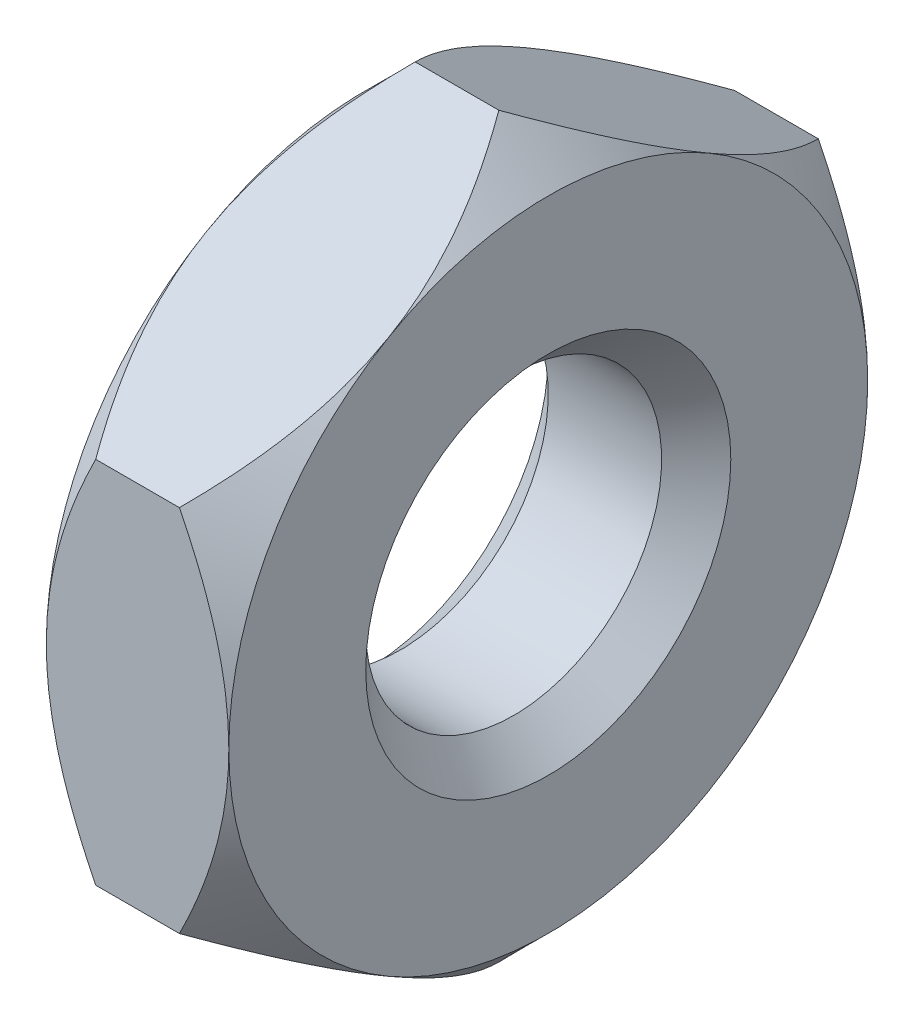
ISO-10303-21;
HEADER;
FILE_DESCRIPTION(('STEP AP214'),'2;1');
FILE_NAME('part.step','',(''),(''),'','','');
FILE_SCHEMA(('AUTOMOTIVE_DESIGN { 1 0 10303 214 1 1 1 1 }'));
ENDSEC;
DATA;
#1=APPLICATION_CONTEXT('core data for automotive mechanical design processes');
#2=APPLICATION_PROTOCOL_DEFINITION('international standard','automotive_design',2000,#1);
#3=PRODUCT_CONTEXT('',#1,'mechanical');
#4=PRODUCT('Part','Part','',(#3));
#5=PRODUCT_RELATED_PRODUCT_CATEGORY('part','',(#4));
#6=PRODUCT_DEFINITION_FORMATION('','',#4);
#7=PRODUCT_DEFINITION_CONTEXT('part definition',#1,'design');
#8=PRODUCT_DEFINITION('design','',#6,#7);
#9=PRODUCT_DEFINITION_SHAPE('','',#8);
#10=(LENGTH_UNIT() NAMED_UNIT(*) SI_UNIT(.MILLI.,.METRE.));
#11=(NAMED_UNIT(*) PLANE_ANGLE_UNIT() SI_UNIT($,.RADIAN.));
#12=(NAMED_UNIT(*) SI_UNIT($,.STERADIAN.) SOLID_ANGLE_UNIT());
#13=UNCERTAINTY_MEASURE_WITH_UNIT(LENGTH_MEASURE(1.E-05),#10,'distance_accuracy_value','');
#14=(GEOMETRIC_REPRESENTATION_CONTEXT(3) GLOBAL_UNCERTAINTY_ASSIGNED_CONTEXT((#13)) GLOBAL_UNIT_ASSIGNED_CONTEXT((#10,
#11,#12)) REPRESENTATION_CONTEXT('',''));
#15=CARTESIAN_POINT('',(0.,0.,0.));
#16=DIRECTION('',(0.,0.,1.));
#17=DIRECTION('',(1.,0.,0.));
#18=AXIS2_PLACEMENT_3D('',#15,#16,#17);
#19=CARTESIAN_POINT('',(0.7,0.,0.));
#20=DIRECTION('',(1.,0.,0.));
#21=DIRECTION('',(0.,0.,-1.));
#22=AXIS2_PLACEMENT_3D('',#19,#20,#21);
#23=CONICAL_SURFACE('',#22,4.2,0.785398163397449);
#24=CARTESIAN_POINT('',(0.541567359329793,-2.02061047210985,-3.5002));
#25=CARTESIAN_POINT('',(0.472167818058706,-2.09007076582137,-3.37989124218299));
#26=CARTESIAN_POINT('',(0.406844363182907,-2.16069251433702,-3.25757078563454));
#27=CARTESIAN_POINT('',(0.28723893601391,-2.30469791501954,-3.00814611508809));
#28=CARTESIAN_POINT('',(0.233023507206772,-2.37809526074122,-2.88101818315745));
#29=CARTESIAN_POINT('',(0.140151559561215,-2.52609746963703,-2.62467083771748));
#30=CARTESIAN_POINT('',(0.1012616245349,-2.60066464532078,-2.49551670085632));
#31=CARTESIAN_POINT('',(0.0413437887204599,-2.75144053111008,-2.23436520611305));
#32=CARTESIAN_POINT('',(0.0202711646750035,-2.82764463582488,-2.10237582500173));
#33=CARTESIAN_POINT('',(0.00125799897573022,-2.9589800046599,-1.87489629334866));
#34=CARTESIAN_POINT('',(-0.00155641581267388,-3.01394167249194,-1.77969989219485));
#35=CARTESIAN_POINT('',(0.00318657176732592,-3.1237756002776,-1.58946194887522));
#36=CARTESIAN_POINT('',(0.0107476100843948,-3.17864782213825,-1.49442047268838));
#37=CARTESIAN_POINT('',(0.0358097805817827,-3.28787240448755,-1.30523794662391));
#38=CARTESIAN_POINT('',(0.0533220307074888,-3.34222411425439,-1.21109802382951));
#39=CARTESIAN_POINT('',(0.0973307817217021,-3.4499940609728,-1.02443500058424));
#40=CARTESIAN_POINT('',(0.123826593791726,-3.50341236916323,-0.931911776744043));
#41=CARTESIAN_POINT('',(0.178339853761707,-3.59824414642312,-0.767658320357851));
#42=CARTESIAN_POINT('',(0.204924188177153,-3.63986754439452,-0.695564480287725));
#43=CARTESIAN_POINT('',(0.262377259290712,-3.72236709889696,-0.552671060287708));
#44=CARTESIAN_POINT('',(0.293246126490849,-3.76324323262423,-0.481871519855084));
#45=CARTESIAN_POINT('',(0.358576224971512,-3.84411947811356,-0.341789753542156));
#46=CARTESIAN_POINT('',(0.393026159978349,-3.88412189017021,-0.272503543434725));
#47=CARTESIAN_POINT('',(0.465065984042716,-3.96338588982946,-0.135214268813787));
#48=CARTESIAN_POINT('',(0.502653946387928,-4.00264791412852,-0.0672104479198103));
#49=CARTESIAN_POINT('',(0.541567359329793,-4.04156735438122,0.000199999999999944));
#50=B_SPLINE_CURVE_WITH_KNOTS('',3,(#24,#25,#26,#27,#28,#29,#30,#31,#32,#33,#34,#35,#36,#37,#38,
#39,#40,#41,#42,#43,#44,#45,#46,#47,#48,#49),.UNSPECIFIED.,.F.,.F.,(4,2,2,2,2,2,2,2,2,2,2,2,4),
(0.,0.466195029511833,0.935106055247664,1.3965703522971,1.85687285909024,2.18628459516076,
2.51581179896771,2.84570789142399,3.17557869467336,3.43762138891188,3.6996720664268,
3.96091985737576,4.22200840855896),.UNSPECIFIED.);
#51=CARTESIAN_POINT('',(0.,-3.03108891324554,-1.75));
#52=VERTEX_POINT('',#51);
#53=CARTESIAN_POINT('',(0.54145188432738,-4.04145188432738,0.));
#54=VERTEX_POINT('',#53);
#55=EDGE_CURVE('E306',#52,#54,#50,.T.);
#56=ORIENTED_EDGE('',*,*,#55,.T.);
#57=CARTESIAN_POINT('',(0.541567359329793,-4.04156735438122,-0.0002));
#58=CARTESIAN_POINT('',(0.472167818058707,-3.9721070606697,0.120108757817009));
#59=CARTESIAN_POINT('',(0.406844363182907,-3.90148531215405,0.242429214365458));
#60=CARTESIAN_POINT('',(0.287238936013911,-3.75747991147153,0.491853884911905));
#61=CARTESIAN_POINT('',(0.233023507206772,-3.68408256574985,0.61898181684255));
#62=CARTESIAN_POINT('',(0.140151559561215,-3.53608035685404,0.875329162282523));
#63=CARTESIAN_POINT('',(0.1012616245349,-3.46151318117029,1.00448329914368));
#64=CARTESIAN_POINT('',(0.0413437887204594,-3.31073729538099,1.26563479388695));
#65=CARTESIAN_POINT('',(0.0202711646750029,-3.2345331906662,1.39762417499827));
#66=CARTESIAN_POINT('',(0.00125799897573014,-3.10319782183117,1.62510370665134));
#67=CARTESIAN_POINT('',(-0.00155641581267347,-3.04823615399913,1.72030010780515));
#68=CARTESIAN_POINT('',(0.0031865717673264,-2.93840222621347,1.91053805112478));
#69=CARTESIAN_POINT('',(0.0107476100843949,-2.88353000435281,2.00557952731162));
#70=CARTESIAN_POINT('',(0.0358097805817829,-2.77430542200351,2.1947620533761));
#71=CARTESIAN_POINT('',(0.0533220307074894,-2.71995371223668,2.28890197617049));
#72=CARTESIAN_POINT('',(0.0973307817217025,-2.61218376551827,2.47556499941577));
#73=CARTESIAN_POINT('',(0.123826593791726,-2.55876545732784,2.56808822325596));
#74=CARTESIAN_POINT('',(0.178339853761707,-2.46393368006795,2.73234167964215));
#75=CARTESIAN_POINT('',(0.204924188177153,-2.42231028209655,2.80443551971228));
#76=CARTESIAN_POINT('',(0.262377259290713,-2.33981072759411,2.94732893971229));
#77=CARTESIAN_POINT('',(0.293246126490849,-2.29893459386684,3.01812848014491));
#78=CARTESIAN_POINT('',(0.358576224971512,-2.21805834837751,3.15821024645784));
#79=CARTESIAN_POINT('',(0.39302615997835,-2.17805593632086,3.22749645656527));
#80=CARTESIAN_POINT('',(0.465065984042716,-2.09879193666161,3.36478573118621));
#81=CARTESIAN_POINT('',(0.502653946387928,-2.05952991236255,3.43278955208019));
#82=CARTESIAN_POINT('',(0.541567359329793,-2.02061047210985,3.5002));
#83=B_SPLINE_CURVE_WITH_KNOTS('',3,(#57,#58,#59,#60,#61,#62,#63,#64,#65,#66,#67,#68,#69,#70,#71,
#72,#73,#74,#75,#76,#77,#78,#79,#80,#81,#82),.UNSPECIFIED.,.F.,.F.,(4,2,2,2,2,2,2,2,2,2,2,2,4),
(0.,0.466195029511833,0.935106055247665,1.3965703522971,1.85687285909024,2.18628459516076,
2.51581179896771,2.84570789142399,3.17557869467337,3.43762138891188,3.69967206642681,
3.96091985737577,4.22200840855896),.UNSPECIFIED.);
#84=CARTESIAN_POINT('',(0.,-3.03108891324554,1.75));
#85=VERTEX_POINT('',#84);
#86=EDGE_CURVE('E234',#54,#85,#83,.T.);
#87=ORIENTED_EDGE('',*,*,#86,.T.);
#88=CARTESIAN_POINT('',(0.,0.,0.));
#89=DIRECTION('',(-1.,0.,0.));
#90=DIRECTION('',(0.,0.,1.));
#91=AXIS2_PLACEMENT_3D('',#88,#89,#90);
#92=CIRCLE('',#91,3.5);
#93=EDGE_CURVE('E270',#52,#85,#92,.T.);
#94=ORIENTED_EDGE('',*,*,#93,.F.);
#95=EDGE_LOOP('',(#56,#87,#94));
#96=FACE_BOUND('',#95,.T.);
#97=ADVANCED_FACE('F16',(#96),#23,.T.);
#98=CARTESIAN_POINT('',(0.,0.,3.5));
#99=VERTEX_POINT('',#98);
#100=EDGE_CURVE('E25',#85,#99,#92,.T.);
#101=ORIENTED_EDGE('',*,*,#100,.F.);
#102=CARTESIAN_POINT('',(0.54145188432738,-2.02072594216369,3.5));
#103=VERTEX_POINT('',#102);
#104=EDGE_CURVE('E235',#85,#103,#83,.T.);
#105=ORIENTED_EDGE('',*,*,#104,.T.);
#106=CARTESIAN_POINT('',(2.02992769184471,-4.2813666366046,3.5));
#107=CARTESIAN_POINT('',(1.95005182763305,-4.17817377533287,3.5));
#108=CARTESIAN_POINT('',(1.87087377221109,-4.0744322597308,3.5));
#109=CARTESIAN_POINT('',(1.71423418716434,-3.86562507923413,3.5));
#110=CARTESIAN_POINT('',(1.63677305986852,-3.760559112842,3.5));
#111=CARTESIAN_POINT('',(1.4833373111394,-3.54810930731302,3.5));
#112=CARTESIAN_POINT('',(1.40737872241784,-3.44071385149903,3.5));
#113=CARTESIAN_POINT('',(1.25804363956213,-3.22414844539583,3.5));
#114=CARTESIAN_POINT('',(1.18466696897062,-3.11497861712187,3.5));
#115=CARTESIAN_POINT('',(1.03638001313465,-2.88733245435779,3.5));
#116=CARTESIAN_POINT('',(0.961684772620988,-2.76871533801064,3.5));
#117=CARTESIAN_POINT('',(0.816841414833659,-2.52869176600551,3.5));
#118=CARTESIAN_POINT('',(0.746694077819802,-2.40728483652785,3.5));
#119=CARTESIAN_POINT('',(0.612433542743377,-2.1616334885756,3.5));
#120=CARTESIAN_POINT('',(0.548302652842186,-2.03739881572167,3.5));
#121=CARTESIAN_POINT('',(0.427512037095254,-1.78537765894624,3.5));
#122=CARTESIAN_POINT('',(0.370848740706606,-1.65759290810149,3.5));
#123=CARTESIAN_POINT('',(0.272479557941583,-1.41171059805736,3.5));
#124=CARTESIAN_POINT('',(0.229829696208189,-1.29399455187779,3.5));
#125=CARTESIAN_POINT('',(0.153947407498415,-1.05550844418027,3.5));
#126=CARTESIAN_POINT('',(0.120715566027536,-0.934738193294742,3.5));
#127=CARTESIAN_POINT('',(0.0660452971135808,-0.693001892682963,3.5));
#128=CARTESIAN_POINT('',(0.0443884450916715,-0.572086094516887,3.5));
#129=CARTESIAN_POINT('',(0.0133295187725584,-0.328681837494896,3.5));
#130=CARTESIAN_POINT('',(0.00392473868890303,-0.206193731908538,3.5));
#131=CARTESIAN_POINT('',(-0.00179447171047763,0.0333925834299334,3.5));
#132=CARTESIAN_POINT('',(0.00130327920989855,0.15047684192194,3.5));
#133=CARTESIAN_POINT('',(0.0190534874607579,0.383760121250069,3.5));
#134=CARTESIAN_POINT('',(0.0337069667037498,0.499959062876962,3.5));
#135=CARTESIAN_POINT('',(0.073979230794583,0.732602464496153,3.5));
#136=CARTESIAN_POINT('',(0.0997940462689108,0.849012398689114,3.5));
#137=CARTESIAN_POINT('',(0.160937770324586,1.07925794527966,3.5));
#138=CARTESIAN_POINT('',(0.196266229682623,1.19309367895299,3.5));
#139=CARTESIAN_POINT('',(0.276696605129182,1.42323940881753,3.5));
#140=CARTESIAN_POINT('',(0.322179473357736,1.53941469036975,3.5));
#141=CARTESIAN_POINT('',(0.420176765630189,1.76876912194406,3.5));
#142=CARTESIAN_POINT('',(0.47269341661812,1.88194730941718,3.5));
#143=CARTESIAN_POINT('',(0.583522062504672,2.1058601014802,3.5));
#144=CARTESIAN_POINT('',(0.641852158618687,2.21658567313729,3.5));
#145=CARTESIAN_POINT('',(0.763022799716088,2.43550235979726,3.5));
#146=CARTESIAN_POINT('',(0.825862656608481,2.54369385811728,3.5));
#147=CARTESIAN_POINT('',(0.951986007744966,2.75259212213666,3.5));
#148=CARTESIAN_POINT('',(1.01509484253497,2.85340489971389,3.5));
#149=CARTESIAN_POINT('',(1.1440067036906,3.05329816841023,3.5));
#150=CARTESIAN_POINT('',(1.20980993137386,3.15237852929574,3.5));
#151=CARTESIAN_POINT('',(1.34309688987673,3.34823905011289,3.5));
#152=CARTESIAN_POINT('',(1.41056296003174,3.44503127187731,3.5));
#153=CARTESIAN_POINT('',(1.54730966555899,3.63728665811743,3.5));
#154=CARTESIAN_POINT('',(1.61658979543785,3.73275018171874,3.5));
#155=CARTESIAN_POINT('',(1.68661268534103,3.82765609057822,3.5));
#156=B_SPLINE_CURVE_WITH_KNOTS('',3,(#106,#107,#108,#109,#110,#111,#112,#113,#114,#115,#116,
#117,#118,#119,#120,#121,#122,#123,#124,#125,#126,#127,#128,#129,#130,#131,#132,#133,#134,#135,
#136,#137,#138,#139,#140,#141,#142,#143,#144,#145,#146,#147,#148,#149,#150,#151,#152,#153,#154,
#155),.UNSPECIFIED.,.F.,.F.,(4,2,2,2,2,2,2,2,2,2,2,2,2,2,2,2,2,2,2,2,2,2,2,2,4),(0.,
0.391491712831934,0.783074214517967,1.17767101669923,1.57224079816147,1.99268868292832,
2.41320851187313,2.8324502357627,3.25149077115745,3.6267814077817,4.00209537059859,
4.37005174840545,4.73792685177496,5.08871223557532,5.43952864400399,5.79677417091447,
6.15400283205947,6.52800132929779,6.90211851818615,7.2774393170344,7.65270297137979,
8.00946293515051,8.36624960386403,8.72018129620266,9.07401539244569),.UNSPECIFIED.);
#157=EDGE_CURVE('E244',#103,#99,#156,.T.);
#158=ORIENTED_EDGE('',*,*,#157,.T.);
#159=EDGE_LOOP('',(#101,#105,#158));
#160=FACE_BOUND('',#159,.T.);
#161=ADVANCED_FACE('F296',(#160),#23,.T.);
#162=CARTESIAN_POINT('',(0.,3.03108891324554,1.75));
#163=VERTEX_POINT('',#162);
#164=EDGE_CURVE('E11',#99,#163,#92,.T.);
#165=ORIENTED_EDGE('',*,*,#164,.F.);
#166=CARTESIAN_POINT('',(0.54145188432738,2.02072594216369,3.5));
#167=VERTEX_POINT('',#166);
#168=EDGE_CURVE('E135',#99,#167,#156,.T.);
#169=ORIENTED_EDGE('',*,*,#168,.T.);
#170=CARTESIAN_POINT('',(0.541567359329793,2.02061047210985,3.5002));
#171=CARTESIAN_POINT('',(0.472167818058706,2.09007076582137,3.37989124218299));
#172=CARTESIAN_POINT('',(0.406844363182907,2.16069251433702,3.25757078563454));
#173=CARTESIAN_POINT('',(0.28723893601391,2.30469791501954,3.00814611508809));
#174=CARTESIAN_POINT('',(0.233023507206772,2.37809526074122,2.88101818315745));
#175=CARTESIAN_POINT('',(0.140151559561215,2.52609746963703,2.62467083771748));
#176=CARTESIAN_POINT('',(0.1012616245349,2.60066464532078,2.49551670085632));
#177=CARTESIAN_POINT('',(0.0413437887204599,2.75144053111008,2.23436520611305));
#178=CARTESIAN_POINT('',(0.0202711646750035,2.82764463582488,2.10237582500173));
#179=CARTESIAN_POINT('',(0.00125799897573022,2.9589800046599,1.87489629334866));
#180=CARTESIAN_POINT('',(-0.00155641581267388,3.01394167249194,1.77969989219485));
#181=CARTESIAN_POINT('',(0.00318657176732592,3.1237756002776,1.58946194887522));
#182=CARTESIAN_POINT('',(0.0107476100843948,3.17864782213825,1.49442047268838));
#183=CARTESIAN_POINT('',(0.0358097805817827,3.28787240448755,1.30523794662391));
#184=CARTESIAN_POINT('',(0.0533220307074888,3.34222411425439,1.21109802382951));
#185=CARTESIAN_POINT('',(0.0973307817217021,3.4499940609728,1.02443500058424));
#186=CARTESIAN_POINT('',(0.123826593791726,3.50341236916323,0.931911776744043));
#187=CARTESIAN_POINT('',(0.178339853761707,3.59824414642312,0.767658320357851));
#188=CARTESIAN_POINT('',(0.204924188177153,3.63986754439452,0.695564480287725));
#189=CARTESIAN_POINT('',(0.262377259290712,3.72236709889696,0.552671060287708));
#190=CARTESIAN_POINT('',(0.293246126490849,3.76324323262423,0.481871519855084));
#191=CARTESIAN_POINT('',(0.358576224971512,3.84411947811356,0.341789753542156));
#192=CARTESIAN_POINT('',(0.393026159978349,3.88412189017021,0.272503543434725));
#193=CARTESIAN_POINT('',(0.465065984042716,3.96338588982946,0.135214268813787));
#194=CARTESIAN_POINT('',(0.502653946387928,4.00264791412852,0.0672104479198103));
#195=CARTESIAN_POINT('',(0.541567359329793,4.04156735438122,-0.000199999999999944));
#196=B_SPLINE_CURVE_WITH_KNOTS('',3,(#170,#171,#172,#173,#174,#175,#176,#177,#178,#179,#180,
#181,#182,#183,#184,#185,#186,#187,#188,#189,#190,#191,#192,#193,#194,#195),.UNSPECIFIED.,.F.,
.F.,(4,2,2,2,2,2,2,2,2,2,2,2,4),(0.,0.466195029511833,0.935106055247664,1.3965703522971,
1.85687285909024,2.18628459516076,2.51581179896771,2.84570789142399,3.17557869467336,
3.43762138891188,3.6996720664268,3.96091985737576,4.22200840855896),.UNSPECIFIED.);
#197=EDGE_CURVE('E136',#167,#163,#196,.T.);
#198=ORIENTED_EDGE('',*,*,#197,.T.);
#199=EDGE_LOOP('',(#165,#169,#198));
#200=FACE_BOUND('',#199,.T.);
#201=ADVANCED_FACE('F134',(#200),#23,.T.);
#202=CARTESIAN_POINT('',(2.02992769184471,-4.2813666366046,-3.5));
#203=CARTESIAN_POINT('',(1.95005182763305,-4.17817377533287,-3.5));
#204=CARTESIAN_POINT('',(1.87087377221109,-4.0744322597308,-3.5));
#205=CARTESIAN_POINT('',(1.71423418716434,-3.86562507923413,-3.5));
#206=CARTESIAN_POINT('',(1.63677305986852,-3.760559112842,-3.5));
#207=CARTESIAN_POINT('',(1.4833373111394,-3.54810930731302,-3.5));
#208=CARTESIAN_POINT('',(1.40737872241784,-3.44071385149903,-3.5));
#209=CARTESIAN_POINT('',(1.25804363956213,-3.22414844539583,-3.5));
#210=CARTESIAN_POINT('',(1.18466696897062,-3.11497861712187,-3.5));
#211=CARTESIAN_POINT('',(1.03638001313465,-2.88733245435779,-3.5));
#212=CARTESIAN_POINT('',(0.961684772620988,-2.76871533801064,-3.5));
#213=CARTESIAN_POINT('',(0.816841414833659,-2.52869176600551,-3.5));
#214=CARTESIAN_POINT('',(0.746694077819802,-2.40728483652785,-3.5));
#215=CARTESIAN_POINT('',(0.612433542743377,-2.1616334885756,-3.5));
#216=CARTESIAN_POINT('',(0.548302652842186,-2.03739881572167,-3.5));
#217=CARTESIAN_POINT('',(0.427512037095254,-1.78537765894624,-3.5));
#218=CARTESIAN_POINT('',(0.370848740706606,-1.65759290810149,-3.5));
#219=CARTESIAN_POINT('',(0.272479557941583,-1.41171059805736,-3.5));
#220=CARTESIAN_POINT('',(0.229829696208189,-1.29399455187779,-3.5));
#221=CARTESIAN_POINT('',(0.153947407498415,-1.05550844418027,-3.5));
#222=CARTESIAN_POINT('',(0.120715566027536,-0.934738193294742,-3.5));
#223=CARTESIAN_POINT('',(0.0660452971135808,-0.693001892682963,-3.5));
#224=CARTESIAN_POINT('',(0.0443884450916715,-0.572086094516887,-3.5));
#225=CARTESIAN_POINT('',(0.0133295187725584,-0.328681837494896,-3.5));
#226=CARTESIAN_POINT('',(0.00392473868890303,-0.206193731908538,-3.5));
#227=CARTESIAN_POINT('',(-0.00179447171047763,0.0333925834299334,-3.5));
#228=CARTESIAN_POINT('',(0.00130327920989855,0.15047684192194,-3.5));
#229=CARTESIAN_POINT('',(0.0190534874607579,0.383760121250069,-3.5));
#230=CARTESIAN_POINT('',(0.0337069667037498,0.499959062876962,-3.5));
#231=CARTESIAN_POINT('',(0.073979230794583,0.732602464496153,-3.5));
#232=CARTESIAN_POINT('',(0.0997940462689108,0.849012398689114,-3.5));
#233=CARTESIAN_POINT('',(0.160937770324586,1.07925794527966,-3.5));
#234=CARTESIAN_POINT('',(0.196266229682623,1.19309367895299,-3.5));
#235=CARTESIAN_POINT('',(0.276696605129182,1.42323940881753,-3.5));
#236=CARTESIAN_POINT('',(0.322179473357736,1.53941469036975,-3.5));
#237=CARTESIAN_POINT('',(0.420176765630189,1.76876912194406,-3.5));
#238=CARTESIAN_POINT('',(0.47269341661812,1.88194730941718,-3.5));
#239=CARTESIAN_POINT('',(0.583522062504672,2.1058601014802,-3.5));
#240=CARTESIAN_POINT('',(0.641852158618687,2.21658567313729,-3.5));
#241=CARTESIAN_POINT('',(0.763022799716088,2.43550235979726,-3.5));
#242=CARTESIAN_POINT('',(0.825862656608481,2.54369385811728,-3.5));
#243=CARTESIAN_POINT('',(0.951986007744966,2.75259212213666,-3.5));
#244=CARTESIAN_POINT('',(1.01509484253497,2.85340489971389,-3.5));
#245=CARTESIAN_POINT('',(1.1440067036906,3.05329816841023,-3.5));
#246=CARTESIAN_POINT('',(1.20980993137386,3.15237852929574,-3.5));
#247=CARTESIAN_POINT('',(1.34309688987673,3.34823905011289,-3.5));
#248=CARTESIAN_POINT('',(1.41056296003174,3.44503127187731,-3.5));
#249=CARTESIAN_POINT('',(1.54730966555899,3.63728665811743,-3.5));
#250=CARTESIAN_POINT('',(1.61658979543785,3.73275018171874,-3.5));
#251=CARTESIAN_POINT('',(1.68661268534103,3.82765609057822,-3.5));
#252=B_SPLINE_CURVE_WITH_KNOTS('',3,(#202,#203,#204,#205,#206,#207,#208,#209,#210,#211,#212,
#213,#214,#215,#216,#217,#218,#219,#220,#221,#222,#223,#224,#225,#226,#227,#228,#229,#230,#231,
#232,#233,#234,#235,#236,#237,#238,#239,#240,#241,#242,#243,#244,#245,#246,#247,#248,#249,#250,
#251),.UNSPECIFIED.,.F.,.F.,(4,2,2,2,2,2,2,2,2,2,2,2,2,2,2,2,2,2,2,2,2,2,2,2,4),(0.,
0.391491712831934,0.783074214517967,1.17767101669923,1.57224079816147,1.99268868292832,
2.41320851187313,2.8324502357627,3.25149077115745,3.6267814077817,4.00209537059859,
4.37005174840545,4.73792685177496,5.08871223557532,5.43952864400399,5.79677417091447,
6.15400283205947,6.52800132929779,6.90211851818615,7.2774393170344,7.65270297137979,
8.00946293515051,8.36624960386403,8.72018129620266,9.07401539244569),.UNSPECIFIED.);
#253=CARTESIAN_POINT('',(0.,0.,-3.5));
#254=VERTEX_POINT('',#253);
#255=CARTESIAN_POINT('',(0.54145188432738,-2.02072594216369,-3.5));
#256=VERTEX_POINT('',#255);
#257=EDGE_CURVE('E362',#254,#256,#252,.F.);
#258=ORIENTED_EDGE('',*,*,#257,.T.);
#259=EDGE_CURVE('E310',#256,#52,#50,.T.);
#260=ORIENTED_EDGE('',*,*,#259,.T.);
#261=EDGE_CURVE('E126',#254,#52,#92,.T.);
#262=ORIENTED_EDGE('',*,*,#261,.F.);
#263=EDGE_LOOP('',(#258,#260,#262));
#264=FACE_BOUND('',#263,.T.);
#265=ADVANCED_FACE('F369',(#264),#23,.T.);
#266=CARTESIAN_POINT('',(0.,3.03108891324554,-1.75));
#267=VERTEX_POINT('',#266);
#268=EDGE_CURVE('E24',#163,#267,#92,.T.);
#269=ORIENTED_EDGE('',*,*,#268,.F.);
#270=CARTESIAN_POINT('',(0.54145188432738,4.04145188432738,0.));
#271=VERTEX_POINT('',#270);
#272=EDGE_CURVE('E117',#163,#271,#196,.T.);
#273=ORIENTED_EDGE('',*,*,#272,.T.);
#274=CARTESIAN_POINT('',(0.541567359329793,4.04156735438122,0.0002));
#275=CARTESIAN_POINT('',(0.472167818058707,3.9721070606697,-0.120108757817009));
#276=CARTESIAN_POINT('',(0.406844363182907,3.90148531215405,-0.242429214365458));
#277=CARTESIAN_POINT('',(0.287238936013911,3.75747991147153,-0.491853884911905));
#278=CARTESIAN_POINT('',(0.233023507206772,3.68408256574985,-0.61898181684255));
#279=CARTESIAN_POINT('',(0.140151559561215,3.53608035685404,-0.875329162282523));
#280=CARTESIAN_POINT('',(0.1012616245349,3.46151318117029,-1.00448329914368));
#281=CARTESIAN_POINT('',(0.0413437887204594,3.31073729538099,-1.26563479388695));
#282=CARTESIAN_POINT('',(0.0202711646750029,3.2345331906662,-1.39762417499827));
#283=CARTESIAN_POINT('',(0.00125799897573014,3.10319782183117,-1.62510370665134));
#284=CARTESIAN_POINT('',(-0.00155641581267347,3.04823615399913,-1.72030010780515));
#285=CARTESIAN_POINT('',(0.0031865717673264,2.93840222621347,-1.91053805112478));
#286=CARTESIAN_POINT('',(0.0107476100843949,2.88353000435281,-2.00557952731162));
#287=CARTESIAN_POINT('',(0.0358097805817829,2.77430542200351,-2.1947620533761));
#288=CARTESIAN_POINT('',(0.0533220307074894,2.71995371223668,-2.28890197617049));
#289=CARTESIAN_POINT('',(0.0973307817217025,2.61218376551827,-2.47556499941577));
#290=CARTESIAN_POINT('',(0.123826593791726,2.55876545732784,-2.56808822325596));
#291=CARTESIAN_POINT('',(0.178339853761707,2.46393368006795,-2.73234167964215));
#292=CARTESIAN_POINT('',(0.204924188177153,2.42231028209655,-2.80443551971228));
#293=CARTESIAN_POINT('',(0.262377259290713,2.33981072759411,-2.94732893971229));
#294=CARTESIAN_POINT('',(0.293246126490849,2.29893459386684,-3.01812848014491));
#295=CARTESIAN_POINT('',(0.358576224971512,2.21805834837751,-3.15821024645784));
#296=CARTESIAN_POINT('',(0.39302615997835,2.17805593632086,-3.22749645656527));
#297=CARTESIAN_POINT('',(0.465065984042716,2.09879193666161,-3.36478573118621));
#298=CARTESIAN_POINT('',(0.502653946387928,2.05952991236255,-3.43278955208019));
#299=CARTESIAN_POINT('',(0.541567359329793,2.02061047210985,-3.5002));
#300=B_SPLINE_CURVE_WITH_KNOTS('',3,(#274,#275,#276,#277,#278,#279,#280,#281,#282,#283,#284,
#285,#286,#287,#288,#289,#290,#291,#292,#293,#294,#295,#296,#297,#298,#299),.UNSPECIFIED.,.F.,
.F.,(4,2,2,2,2,2,2,2,2,2,2,2,4),(0.,0.466195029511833,0.935106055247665,1.3965703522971,
1.85687285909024,2.18628459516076,2.51581179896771,2.84570789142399,3.17557869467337,
3.43762138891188,3.69967206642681,3.96091985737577,4.22200840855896),.UNSPECIFIED.);
#301=EDGE_CURVE('E106',#271,#267,#300,.T.);
#302=ORIENTED_EDGE('',*,*,#301,.T.);
#303=EDGE_LOOP('',(#269,#273,#302));
#304=FACE_BOUND('',#303,.T.);
#305=ADVANCED_FACE('F115',(#304),#23,.T.);
#306=CARTESIAN_POINT('',(2.,0.,0.));
#307=DIRECTION('',(-1.,0.,0.));
#308=DIRECTION('',(0.,0.,1.));
#309=AXIS2_PLACEMENT_3D('',#306,#307,#308);
#310=CONICAL_SURFACE('',#309,3.5,0.785398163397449);
#311=CARTESIAN_POINT('',(1.45843264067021,2.02061047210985,-3.5002));
#312=CARTESIAN_POINT('',(1.52783218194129,2.09007076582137,-3.37989124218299));
#313=CARTESIAN_POINT('',(1.59315563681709,2.16069251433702,-3.25757078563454));
#314=CARTESIAN_POINT('',(1.71276106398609,2.30469791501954,-3.00814611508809));
#315=CARTESIAN_POINT('',(1.76697649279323,2.37809526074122,-2.88101818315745));
#316=CARTESIAN_POINT('',(1.85984844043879,2.52609746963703,-2.62467083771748));
#317=CARTESIAN_POINT('',(1.8987383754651,2.60066464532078,-2.49551670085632));
#318=CARTESIAN_POINT('',(1.95865621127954,2.75144053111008,-2.23436520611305));
#319=CARTESIAN_POINT('',(1.979728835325,2.82764463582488,-2.10237582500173));
#320=CARTESIAN_POINT('',(1.99874200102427,2.9589800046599,-1.87489629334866));
#321=CARTESIAN_POINT('',(2.00155641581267,3.01394167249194,-1.77969989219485));
#322=CARTESIAN_POINT('',(1.99681342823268,3.1237756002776,-1.58946194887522));
#323=CARTESIAN_POINT('',(1.98925238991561,3.17864782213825,-1.49442047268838));
#324=CARTESIAN_POINT('',(1.96419021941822,3.28787240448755,-1.3052379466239));
#325=CARTESIAN_POINT('',(1.94667796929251,3.34222411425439,-1.21109802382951));
#326=CARTESIAN_POINT('',(1.9026692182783,3.4499940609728,-1.02443500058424));
#327=CARTESIAN_POINT('',(1.87617340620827,3.50341236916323,-0.931911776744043));
#328=CARTESIAN_POINT('',(1.82166014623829,3.59824414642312,-0.76765832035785));
#329=CARTESIAN_POINT('',(1.79507581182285,3.63986754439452,-0.695564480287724));
#330=CARTESIAN_POINT('',(1.73762274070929,3.72236709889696,-0.552671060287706));
#331=CARTESIAN_POINT('',(1.70675387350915,3.76324323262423,-0.481871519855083));
#332=CARTESIAN_POINT('',(1.64142377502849,3.84411947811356,-0.341789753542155));
#333=CARTESIAN_POINT('',(1.60697384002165,3.88412189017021,-0.272503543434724));
#334=CARTESIAN_POINT('',(1.53493401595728,3.96338588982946,-0.135214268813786));
#335=CARTESIAN_POINT('',(1.49734605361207,4.00264791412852,-0.0672104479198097));
#336=CARTESIAN_POINT('',(1.45843264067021,4.04156735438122,0.000200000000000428));
#337=B_SPLINE_CURVE_WITH_KNOTS('',3,(#311,#312,#313,#314,#315,#316,#317,#318,#319,#320,#321,
#322,#323,#324,#325,#326,#327,#328,#329,#330,#331,#332,#333,#334,#335,#336),.UNSPECIFIED.,.F.,
.F.,(4,2,2,2,2,2,2,2,2,2,2,2,4),(0.,0.466195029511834,0.935106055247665,1.3965703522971,
1.85687285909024,2.18628459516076,2.51581179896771,2.84570789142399,3.17557869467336,
3.43762138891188,3.69967206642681,3.96091985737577,4.22200840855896),.UNSPECIFIED.);
#338=CARTESIAN_POINT('',(2.,3.03108891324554,-1.75));
#339=VERTEX_POINT('',#338);
#340=CARTESIAN_POINT('',(1.45854811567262,4.04145188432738,0.));
#341=VERTEX_POINT('',#340);
#342=EDGE_CURVE('E194',#339,#341,#337,.T.);
#343=ORIENTED_EDGE('',*,*,#342,.T.);
#344=CARTESIAN_POINT('',(1.45843264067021,4.04156735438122,-0.000200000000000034));
#345=CARTESIAN_POINT('',(1.52783218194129,3.9721070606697,0.120108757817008));
#346=CARTESIAN_POINT('',(1.59315563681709,3.90148531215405,0.242429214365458));
#347=CARTESIAN_POINT('',(1.71276106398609,3.75747991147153,0.491853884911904));
#348=CARTESIAN_POINT('',(1.76697649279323,3.68408256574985,0.61898181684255));
#349=CARTESIAN_POINT('',(1.85984844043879,3.53608035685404,0.875329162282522));
#350=CARTESIAN_POINT('',(1.8987383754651,3.46151318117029,1.00448329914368));
#351=CARTESIAN_POINT('',(1.95865621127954,3.31073729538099,1.26563479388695));
#352=CARTESIAN_POINT('',(1.979728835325,3.2345331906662,1.39762417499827));
#353=CARTESIAN_POINT('',(1.99874200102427,3.10319782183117,1.62510370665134));
#354=CARTESIAN_POINT('',(2.00155641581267,3.04823615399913,1.72030010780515));
#355=CARTESIAN_POINT('',(1.99681342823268,2.93840222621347,1.91053805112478));
#356=CARTESIAN_POINT('',(1.98925238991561,2.88353000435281,2.00557952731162));
#357=CARTESIAN_POINT('',(1.96419021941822,2.77430542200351,2.1947620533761));
#358=CARTESIAN_POINT('',(1.94667796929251,2.71995371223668,2.28890197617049));
#359=CARTESIAN_POINT('',(1.9026692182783,2.61218376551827,2.47556499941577));
#360=CARTESIAN_POINT('',(1.87617340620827,2.55876545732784,2.56808822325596));
#361=CARTESIAN_POINT('',(1.82166014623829,2.46393368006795,2.73234167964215));
#362=CARTESIAN_POINT('',(1.79507581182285,2.42231028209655,2.80443551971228));
#363=CARTESIAN_POINT('',(1.73762274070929,2.33981072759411,2.94732893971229));
#364=CARTESIAN_POINT('',(1.70675387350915,2.29893459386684,3.01812848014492));
#365=CARTESIAN_POINT('',(1.64142377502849,2.21805834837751,3.15821024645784));
#366=CARTESIAN_POINT('',(1.60697384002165,2.17805593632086,3.22749645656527));
#367=CARTESIAN_POINT('',(1.53493401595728,2.09879193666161,3.36478573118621));
#368=CARTESIAN_POINT('',(1.49734605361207,2.05952991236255,3.43278955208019));
#369=CARTESIAN_POINT('',(1.45843264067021,2.02061047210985,3.5002));
#370=B_SPLINE_CURVE_WITH_KNOTS('',3,(#344,#345,#346,#347,#348,#349,#350,#351,#352,#353,#354,
#355,#356,#357,#358,#359,#360,#361,#362,#363,#364,#365,#366,#367,#368,#369),.UNSPECIFIED.,.F.,
.F.,(4,2,2,2,2,2,2,2,2,2,2,2,4),(0.,0.466195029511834,0.935106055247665,1.3965703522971,
1.85687285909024,2.18628459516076,2.51581179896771,2.845707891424,3.17557869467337,
3.43762138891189,3.69967206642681,3.96091985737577,4.22200840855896),.UNSPECIFIED.);
#371=CARTESIAN_POINT('',(2.,3.03108891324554,1.75));
#372=VERTEX_POINT('',#371);
#373=EDGE_CURVE('E145',#341,#372,#370,.T.);
#374=ORIENTED_EDGE('',*,*,#373,.T.);
#375=CARTESIAN_POINT('',(2.,0.,0.));
#376=DIRECTION('',(-1.,0.,0.));
#377=DIRECTION('',(0.,0.,1.));
#378=AXIS2_PLACEMENT_3D('',#375,#376,#377);
#379=CIRCLE('',#378,3.5);
#380=EDGE_CURVE('E269',#372,#339,#379,.T.);
#381=ORIENTED_EDGE('',*,*,#380,.T.);
#382=EDGE_LOOP('',(#343,#374,#381));
#383=FACE_BOUND('',#382,.T.);
#384=ADVANCED_FACE('F189',(#383),#310,.T.);
#385=CARTESIAN_POINT('',(2.,0.,3.5));
#386=VERTEX_POINT('',#385);
#387=EDGE_CURVE('E253',#386,#372,#379,.T.);
#388=ORIENTED_EDGE('',*,*,#387,.T.);
#389=CARTESIAN_POINT('',(1.45854811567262,2.02072594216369,3.5));
#390=VERTEX_POINT('',#389);
#391=EDGE_CURVE('E152',#372,#390,#370,.T.);
#392=ORIENTED_EDGE('',*,*,#391,.T.);
#393=CARTESIAN_POINT('',(-0.0299276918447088,-4.2813666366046,3.5));
#394=CARTESIAN_POINT('',(0.0499481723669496,-4.17817377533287,3.5));
#395=CARTESIAN_POINT('',(0.129126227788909,-4.0744322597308,3.5));
#396=CARTESIAN_POINT('',(0.285765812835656,-3.86562507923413,3.5));
#397=CARTESIAN_POINT('',(0.36322694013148,-3.760559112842,3.5));
#398=CARTESIAN_POINT('',(0.516662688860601,-3.54810930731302,3.5));
#399=CARTESIAN_POINT('',(0.592621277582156,-3.44071385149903,3.5));
#400=CARTESIAN_POINT('',(0.74195636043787,-3.22414844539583,3.5));
#401=CARTESIAN_POINT('',(0.815333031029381,-3.11497861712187,3.5));
#402=CARTESIAN_POINT('',(0.96361998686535,-2.88733245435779,3.5));
#403=CARTESIAN_POINT('',(1.03831522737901,-2.76871533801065,3.5));
#404=CARTESIAN_POINT('',(1.18315858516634,-2.52869176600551,3.5));
#405=CARTESIAN_POINT('',(1.2533059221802,-2.40728483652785,3.5));
#406=CARTESIAN_POINT('',(1.38756645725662,-2.1616334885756,3.5));
#407=CARTESIAN_POINT('',(1.45169734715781,-2.03739881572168,3.5));
#408=CARTESIAN_POINT('',(1.57248796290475,-1.78537765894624,3.5));
#409=CARTESIAN_POINT('',(1.62915125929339,-1.65759290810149,3.5));
#410=CARTESIAN_POINT('',(1.72752044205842,-1.41171059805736,3.5));
#411=CARTESIAN_POINT('',(1.77017030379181,-1.29399455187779,3.5));
#412=CARTESIAN_POINT('',(1.84605259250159,-1.05550844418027,3.5));
#413=CARTESIAN_POINT('',(1.87928443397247,-0.934738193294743,3.5));
#414=CARTESIAN_POINT('',(1.93395470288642,-0.693001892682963,3.5));
#415=CARTESIAN_POINT('',(1.95561155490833,-0.572086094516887,3.5));
#416=CARTESIAN_POINT('',(1.98667048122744,-0.328681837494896,3.5));
#417=CARTESIAN_POINT('',(1.9960752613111,-0.206193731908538,3.5));
#418=CARTESIAN_POINT('',(2.00179447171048,0.0333925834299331,3.5));
#419=CARTESIAN_POINT('',(1.9986967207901,0.15047684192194,3.5));
#420=CARTESIAN_POINT('',(1.98094651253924,0.383760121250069,3.5));
#421=CARTESIAN_POINT('',(1.96629303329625,0.499959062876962,3.5));
#422=CARTESIAN_POINT('',(1.92602076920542,0.732602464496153,3.5));
#423=CARTESIAN_POINT('',(1.90020595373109,0.849012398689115,3.5));
#424=CARTESIAN_POINT('',(1.83906222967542,1.07925794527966,3.5));
#425=CARTESIAN_POINT('',(1.80373377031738,1.19309367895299,3.5));
#426=CARTESIAN_POINT('',(1.72330339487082,1.42323940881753,3.5));
#427=CARTESIAN_POINT('',(1.67782052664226,1.53941469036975,3.5));
#428=CARTESIAN_POINT('',(1.57982323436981,1.76876912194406,3.5));
#429=CARTESIAN_POINT('',(1.52730658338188,1.88194730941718,3.5));
#430=CARTESIAN_POINT('',(1.41647793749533,2.1058601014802,3.5));
#431=CARTESIAN_POINT('',(1.35814784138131,2.21658567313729,3.5));
#432=CARTESIAN_POINT('',(1.23697720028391,2.43550235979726,3.5));
#433=CARTESIAN_POINT('',(1.17413734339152,2.54369385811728,3.5));
#434=CARTESIAN_POINT('',(1.04801399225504,2.75259212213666,3.5));
#435=CARTESIAN_POINT('',(0.984905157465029,2.85340489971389,3.5));
#436=CARTESIAN_POINT('',(0.855993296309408,3.05329816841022,3.5));
#437=CARTESIAN_POINT('',(0.790190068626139,3.15237852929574,3.5));
#438=CARTESIAN_POINT('',(0.656903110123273,3.34823905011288,3.5));
#439=CARTESIAN_POINT('',(0.589437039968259,3.44503127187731,3.5));
#440=CARTESIAN_POINT('',(0.452690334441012,3.63728665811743,3.5));
#441=CARTESIAN_POINT('',(0.383410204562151,3.73275018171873,3.5));
#442=CARTESIAN_POINT('',(0.313387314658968,3.82765609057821,3.5));
#443=B_SPLINE_CURVE_WITH_KNOTS('',3,(#393,#394,#395,#396,#397,#398,#399,#400,#401,#402,#403,
#404,#405,#406,#407,#408,#409,#410,#411,#412,#413,#414,#415,#416,#417,#418,#419,#420,#421,#422,
#423,#424,#425,#426,#427,#428,#429,#430,#431,#432,#433,#434,#435,#436,#437,#438,#439,#440,#441,
#442),.UNSPECIFIED.,.F.,.F.,(4,2,2,2,2,2,2,2,2,2,2,2,2,2,2,2,2,2,2,2,2,2,2,2,4),(0.,
0.391491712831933,0.783074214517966,1.17767101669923,1.57224079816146,1.99268868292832,
2.41320851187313,2.8324502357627,3.25149077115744,3.6267814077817,4.00209537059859,
4.37005174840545,4.73792685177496,5.08871223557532,5.43952864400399,5.79677417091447,
6.15400283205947,6.52800132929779,6.90211851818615,7.2774393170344,7.65270297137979,
8.00946293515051,8.36624960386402,8.72018129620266,9.07401539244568),.UNSPECIFIED.);
#444=EDGE_CURVE('E233',#390,#386,#443,.F.);
#445=ORIENTED_EDGE('',*,*,#444,.T.);
#446=EDGE_LOOP('',(#388,#392,#445));
#447=FACE_BOUND('',#446,.T.);
#448=ADVANCED_FACE('F251',(#447),#310,.T.);
#449=CARTESIAN_POINT('',(2.,-3.03108891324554,1.75));
#450=VERTEX_POINT('',#449);
#451=EDGE_CURVE('E258',#450,#386,#379,.T.);
#452=ORIENTED_EDGE('',*,*,#451,.T.);
#453=CARTESIAN_POINT('',(1.45854811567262,-2.02072594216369,3.5));
#454=VERTEX_POINT('',#453);
#455=EDGE_CURVE('E227',#386,#454,#443,.F.);
#456=ORIENTED_EDGE('',*,*,#455,.T.);
#457=CARTESIAN_POINT('',(1.45843264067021,-2.02061047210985,3.5002));
#458=CARTESIAN_POINT('',(1.52783218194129,-2.09007076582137,3.37989124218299));
#459=CARTESIAN_POINT('',(1.59315563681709,-2.16069251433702,3.25757078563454));
#460=CARTESIAN_POINT('',(1.71276106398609,-2.30469791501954,3.00814611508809));
#461=CARTESIAN_POINT('',(1.76697649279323,-2.37809526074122,2.88101818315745));
#462=CARTESIAN_POINT('',(1.85984844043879,-2.52609746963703,2.62467083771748));
#463=CARTESIAN_POINT('',(1.8987383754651,-2.60066464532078,2.49551670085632));
#464=CARTESIAN_POINT('',(1.95865621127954,-2.75144053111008,2.23436520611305));
#465=CARTESIAN_POINT('',(1.979728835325,-2.82764463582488,2.10237582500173));
#466=CARTESIAN_POINT('',(1.99874200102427,-2.9589800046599,1.87489629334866));
#467=CARTESIAN_POINT('',(2.00155641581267,-3.01394167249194,1.77969989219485));
#468=CARTESIAN_POINT('',(1.99681342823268,-3.1237756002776,1.58946194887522));
#469=CARTESIAN_POINT('',(1.98925238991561,-3.17864782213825,1.49442047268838));
#470=CARTESIAN_POINT('',(1.96419021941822,-3.28787240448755,1.3052379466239));
#471=CARTESIAN_POINT('',(1.94667796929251,-3.34222411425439,1.21109802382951));
#472=CARTESIAN_POINT('',(1.9026692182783,-3.4499940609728,1.02443500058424));
#473=CARTESIAN_POINT('',(1.87617340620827,-3.50341236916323,0.931911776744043));
#474=CARTESIAN_POINT('',(1.82166014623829,-3.59824414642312,0.76765832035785));
#475=CARTESIAN_POINT('',(1.79507581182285,-3.63986754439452,0.695564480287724));
#476=CARTESIAN_POINT('',(1.73762274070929,-3.72236709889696,0.552671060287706));
#477=CARTESIAN_POINT('',(1.70675387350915,-3.76324323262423,0.481871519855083));
#478=CARTESIAN_POINT('',(1.64142377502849,-3.84411947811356,0.341789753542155));
#479=CARTESIAN_POINT('',(1.60697384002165,-3.88412189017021,0.272503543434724));
#480=CARTESIAN_POINT('',(1.53493401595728,-3.96338588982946,0.135214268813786));
#481=CARTESIAN_POINT('',(1.49734605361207,-4.00264791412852,0.0672104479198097));
#482=CARTESIAN_POINT('',(1.45843264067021,-4.04156735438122,-0.000200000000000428));
#483=B_SPLINE_CURVE_WITH_KNOTS('',3,(#457,#458,#459,#460,#461,#462,#463,#464,#465,#466,#467,
#468,#469,#470,#471,#472,#473,#474,#475,#476,#477,#478,#479,#480,#481,#482),.UNSPECIFIED.,.F.,
.F.,(4,2,2,2,2,2,2,2,2,2,2,2,4),(0.,0.466195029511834,0.935106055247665,1.3965703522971,
1.85687285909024,2.18628459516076,2.51581179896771,2.84570789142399,3.17557869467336,
3.43762138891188,3.69967206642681,3.96091985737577,4.22200840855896),.UNSPECIFIED.);
#484=EDGE_CURVE('E260',#454,#450,#483,.T.);
#485=ORIENTED_EDGE('',*,*,#484,.T.);
#486=EDGE_LOOP('',(#452,#456,#485));
#487=FACE_BOUND('',#486,.T.);
#488=ADVANCED_FACE('F259',(#487),#310,.T.);
#489=CARTESIAN_POINT('',(2.,-3.03108891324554,-1.75));
#490=VERTEX_POINT('',#489);
#491=EDGE_CURVE('E264',#490,#450,#379,.T.);
#492=ORIENTED_EDGE('',*,*,#491,.T.);
#493=CARTESIAN_POINT('',(1.45854811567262,-4.04145188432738,0.));
#494=VERTEX_POINT('',#493);
#495=EDGE_CURVE('E220',#450,#494,#483,.T.);
#496=ORIENTED_EDGE('',*,*,#495,.T.);
#497=CARTESIAN_POINT('',(1.45843264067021,-4.04156735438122,0.000200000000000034));
#498=CARTESIAN_POINT('',(1.52783218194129,-3.9721070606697,-0.120108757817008));
#499=CARTESIAN_POINT('',(1.59315563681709,-3.90148531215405,-0.242429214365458));
#500=CARTESIAN_POINT('',(1.71276106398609,-3.75747991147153,-0.491853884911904));
#501=CARTESIAN_POINT('',(1.76697649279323,-3.68408256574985,-0.61898181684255));
#502=CARTESIAN_POINT('',(1.85984844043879,-3.53608035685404,-0.875329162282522));
#503=CARTESIAN_POINT('',(1.8987383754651,-3.46151318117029,-1.00448329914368));
#504=CARTESIAN_POINT('',(1.95865621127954,-3.31073729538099,-1.26563479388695));
#505=CARTESIAN_POINT('',(1.979728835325,-3.2345331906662,-1.39762417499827));
#506=CARTESIAN_POINT('',(1.99874200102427,-3.10319782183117,-1.62510370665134));
#507=CARTESIAN_POINT('',(2.00155641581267,-3.04823615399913,-1.72030010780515));
#508=CARTESIAN_POINT('',(1.99681342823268,-2.93840222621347,-1.91053805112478));
#509=CARTESIAN_POINT('',(1.98925238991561,-2.88353000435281,-2.00557952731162));
#510=CARTESIAN_POINT('',(1.96419021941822,-2.77430542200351,-2.1947620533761));
#511=CARTESIAN_POINT('',(1.94667796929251,-2.71995371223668,-2.28890197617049));
#512=CARTESIAN_POINT('',(1.9026692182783,-2.61218376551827,-2.47556499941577));
#513=CARTESIAN_POINT('',(1.87617340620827,-2.55876545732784,-2.56808822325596));
#514=CARTESIAN_POINT('',(1.82166014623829,-2.46393368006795,-2.73234167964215));
#515=CARTESIAN_POINT('',(1.79507581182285,-2.42231028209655,-2.80443551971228));
#516=CARTESIAN_POINT('',(1.73762274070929,-2.33981072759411,-2.94732893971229));
#517=CARTESIAN_POINT('',(1.70675387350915,-2.29893459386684,-3.01812848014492));
#518=CARTESIAN_POINT('',(1.64142377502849,-2.21805834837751,-3.15821024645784));
#519=CARTESIAN_POINT('',(1.60697384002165,-2.17805593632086,-3.22749645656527));
#520=CARTESIAN_POINT('',(1.53493401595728,-2.09879193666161,-3.36478573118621));
#521=CARTESIAN_POINT('',(1.49734605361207,-2.05952991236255,-3.43278955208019));
#522=CARTESIAN_POINT('',(1.45843264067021,-2.02061047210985,-3.5002));
#523=B_SPLINE_CURVE_WITH_KNOTS('',3,(#497,#498,#499,#500,#501,#502,#503,#504,#505,#506,#507,
#508,#509,#510,#511,#512,#513,#514,#515,#516,#517,#518,#519,#520,#521,#522),.UNSPECIFIED.,.F.,
.F.,(4,2,2,2,2,2,2,2,2,2,2,2,4),(0.,0.466195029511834,0.935106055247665,1.3965703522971,
1.85687285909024,2.18628459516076,2.51581179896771,2.845707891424,3.17557869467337,
3.43762138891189,3.69967206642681,3.96091985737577,4.22200840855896),.UNSPECIFIED.);
#524=EDGE_CURVE('E311',#494,#490,#523,.T.);
#525=ORIENTED_EDGE('',*,*,#524,.T.);
#526=EDGE_LOOP('',(#492,#496,#525));
#527=FACE_BOUND('',#526,.T.);
#528=ADVANCED_FACE('F293',(#527),#310,.T.);
#529=CARTESIAN_POINT('',(2.,0.,-3.5));
#530=VERTEX_POINT('',#529);
#531=EDGE_CURVE('E356',#530,#490,#379,.T.);
#532=ORIENTED_EDGE('',*,*,#531,.T.);
#533=CARTESIAN_POINT('',(1.45854811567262,-2.02072594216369,-3.5));
#534=VERTEX_POINT('',#533);
#535=EDGE_CURVE('E212',#490,#534,#523,.T.);
#536=ORIENTED_EDGE('',*,*,#535,.T.);
#537=CARTESIAN_POINT('',(-0.0299276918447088,-4.2813666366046,-3.5));
#538=CARTESIAN_POINT('',(0.0499481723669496,-4.17817377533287,-3.5));
#539=CARTESIAN_POINT('',(0.129126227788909,-4.0744322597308,-3.5));
#540=CARTESIAN_POINT('',(0.285765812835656,-3.86562507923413,-3.5));
#541=CARTESIAN_POINT('',(0.36322694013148,-3.760559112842,-3.5));
#542=CARTESIAN_POINT('',(0.516662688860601,-3.54810930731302,-3.5));
#543=CARTESIAN_POINT('',(0.592621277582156,-3.44071385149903,-3.5));
#544=CARTESIAN_POINT('',(0.74195636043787,-3.22414844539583,-3.5));
#545=CARTESIAN_POINT('',(0.815333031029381,-3.11497861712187,-3.5));
#546=CARTESIAN_POINT('',(0.96361998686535,-2.88733245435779,-3.5));
#547=CARTESIAN_POINT('',(1.03831522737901,-2.76871533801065,-3.5));
#548=CARTESIAN_POINT('',(1.18315858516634,-2.52869176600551,-3.5));
#549=CARTESIAN_POINT('',(1.2533059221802,-2.40728483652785,-3.5));
#550=CARTESIAN_POINT('',(1.38756645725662,-2.1616334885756,-3.5));
#551=CARTESIAN_POINT('',(1.45169734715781,-2.03739881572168,-3.5));
#552=CARTESIAN_POINT('',(1.57248796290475,-1.78537765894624,-3.5));
#553=CARTESIAN_POINT('',(1.62915125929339,-1.65759290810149,-3.5));
#554=CARTESIAN_POINT('',(1.72752044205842,-1.41171059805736,-3.5));
#555=CARTESIAN_POINT('',(1.77017030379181,-1.29399455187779,-3.5));
#556=CARTESIAN_POINT('',(1.84605259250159,-1.05550844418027,-3.5));
#557=CARTESIAN_POINT('',(1.87928443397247,-0.934738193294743,-3.5));
#558=CARTESIAN_POINT('',(1.93395470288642,-0.693001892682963,-3.5));
#559=CARTESIAN_POINT('',(1.95561155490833,-0.572086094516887,-3.5));
#560=CARTESIAN_POINT('',(1.98667048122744,-0.328681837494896,-3.5));
#561=CARTESIAN_POINT('',(1.9960752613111,-0.206193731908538,-3.5));
#562=CARTESIAN_POINT('',(2.00179447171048,0.0333925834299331,-3.5));
#563=CARTESIAN_POINT('',(1.9986967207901,0.15047684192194,-3.5));
#564=CARTESIAN_POINT('',(1.98094651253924,0.383760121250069,-3.5));
#565=CARTESIAN_POINT('',(1.96629303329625,0.499959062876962,-3.5));
#566=CARTESIAN_POINT('',(1.92602076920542,0.732602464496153,-3.5));
#567=CARTESIAN_POINT('',(1.90020595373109,0.849012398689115,-3.5));
#568=CARTESIAN_POINT('',(1.83906222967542,1.07925794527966,-3.5));
#569=CARTESIAN_POINT('',(1.80373377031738,1.19309367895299,-3.5));
#570=CARTESIAN_POINT('',(1.72330339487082,1.42323940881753,-3.5));
#571=CARTESIAN_POINT('',(1.67782052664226,1.53941469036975,-3.5));
#572=CARTESIAN_POINT('',(1.57982323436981,1.76876912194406,-3.5));
#573=CARTESIAN_POINT('',(1.52730658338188,1.88194730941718,-3.5));
#574=CARTESIAN_POINT('',(1.41647793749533,2.1058601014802,-3.5));
#575=CARTESIAN_POINT('',(1.35814784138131,2.21658567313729,-3.5));
#576=CARTESIAN_POINT('',(1.23697720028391,2.43550235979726,-3.5));
#577=CARTESIAN_POINT('',(1.17413734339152,2.54369385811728,-3.5));
#578=CARTESIAN_POINT('',(1.04801399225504,2.75259212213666,-3.5));
#579=CARTESIAN_POINT('',(0.984905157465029,2.85340489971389,-3.5));
#580=CARTESIAN_POINT('',(0.855993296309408,3.05329816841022,-3.5));
#581=CARTESIAN_POINT('',(0.790190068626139,3.15237852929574,-3.5));
#582=CARTESIAN_POINT('',(0.656903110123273,3.34823905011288,-3.5));
#583=CARTESIAN_POINT('',(0.589437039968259,3.44503127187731,-3.5));
#584=CARTESIAN_POINT('',(0.452690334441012,3.63728665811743,-3.5));
#585=CARTESIAN_POINT('',(0.383410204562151,3.73275018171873,-3.5));
#586=CARTESIAN_POINT('',(0.313387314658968,3.82765609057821,-3.5));
#587=B_SPLINE_CURVE_WITH_KNOTS('',3,(#537,#538,#539,#540,#541,#542,#543,#544,#545,#546,#547,
#548,#549,#550,#551,#552,#553,#554,#555,#556,#557,#558,#559,#560,#561,#562,#563,#564,#565,#566,
#567,#568,#569,#570,#571,#572,#573,#574,#575,#576,#577,#578,#579,#580,#581,#582,#583,#584,#585,
#586),.UNSPECIFIED.,.F.,.F.,(4,2,2,2,2,2,2,2,2,2,2,2,2,2,2,2,2,2,2,2,2,2,2,2,4),(0.,
0.391491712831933,0.783074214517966,1.17767101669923,1.57224079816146,1.99268868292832,
2.41320851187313,2.8324502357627,3.25149077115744,3.6267814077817,4.00209537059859,
4.37005174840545,4.73792685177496,5.08871223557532,5.43952864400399,5.79677417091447,
6.15400283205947,6.52800132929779,6.90211851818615,7.2774393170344,7.65270297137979,
8.00946293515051,8.36624960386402,8.72018129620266,9.07401539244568),.UNSPECIFIED.);
#588=EDGE_CURVE('E359',#534,#530,#587,.T.);
#589=ORIENTED_EDGE('',*,*,#588,.T.);
#590=EDGE_LOOP('',(#532,#536,#589));
#591=FACE_BOUND('',#590,.T.);
#592=ADVANCED_FACE('F190',(#591),#310,.T.);
#593=CARTESIAN_POINT('',(0.,0.,0.));
#594=DIRECTION('',(1.,0.,0.));
#595=DIRECTION('',(0.,0.,-1.));
#596=AXIS2_PLACEMENT_3D('',#593,#594,#595);
#597=PLANE('',#596);
#598=CARTESIAN_POINT('',(0.,0.,0.));
#599=DIRECTION('',(-1.,0.,0.));
#600=DIRECTION('',(0.,0.,1.));
#601=AXIS2_PLACEMENT_3D('',#598,#599,#600);
#602=CIRCLE('',#601,2.);
#603=CARTESIAN_POINT('',(0.,0.,2.));
#604=VERTEX_POINT('',#603);
#605=EDGE_CURVE('E265',#604,#604,#602,.T.);
#606=ORIENTED_EDGE('',*,*,#605,.F.);
#607=EDGE_LOOP('',(#606));
#608=FACE_BOUND('',#607,.T.);
#609=ORIENTED_EDGE('',*,*,#164,.T.);
#610=ORIENTED_EDGE('',*,*,#268,.T.);
#611=EDGE_CURVE('E120',#267,#254,#92,.T.);
#612=ORIENTED_EDGE('',*,*,#611,.T.);
#613=ORIENTED_EDGE('',*,*,#261,.T.);
#614=ORIENTED_EDGE('',*,*,#93,.T.);
#615=ORIENTED_EDGE('',*,*,#100,.T.);
#616=EDGE_LOOP('',(#609,#610,#612,#613,#614,#615));
#617=FACE_BOUND('',#616,.T.);
#618=ADVANCED_FACE('F18',(#608,#617),#597,.F.);
#619=CARTESIAN_POINT('',(0.54145188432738,2.02072594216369,-3.5));
#620=VERTEX_POINT('',#619);
#621=EDGE_CURVE('E103',#267,#620,#300,.T.);
#622=ORIENTED_EDGE('',*,*,#621,.T.);
#623=EDGE_CURVE('E122',#620,#254,#252,.F.);
#624=ORIENTED_EDGE('',*,*,#623,.T.);
#625=ORIENTED_EDGE('',*,*,#611,.F.);
#626=EDGE_LOOP('',(#622,#624,#625));
#627=FACE_BOUND('',#626,.T.);
#628=ADVANCED_FACE('F121',(#627),#23,.T.);
#629=EDGE_CURVE('E271',#339,#530,#379,.T.);
#630=ORIENTED_EDGE('',*,*,#629,.T.);
#631=CARTESIAN_POINT('',(1.45854811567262,2.02072594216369,-3.5));
#632=VERTEX_POINT('',#631);
#633=EDGE_CURVE('E118',#530,#632,#587,.T.);
#634=ORIENTED_EDGE('',*,*,#633,.T.);
#635=EDGE_CURVE('E110',#632,#339,#337,.T.);
#636=ORIENTED_EDGE('',*,*,#635,.T.);
#637=EDGE_LOOP('',(#630,#634,#636));
#638=FACE_BOUND('',#637,.T.);
#639=ADVANCED_FACE('F184',(#638),#310,.T.);
#640=CARTESIAN_POINT('',(2.,3.5,0.));
#641=DIRECTION('',(-1.,0.,0.));
#642=DIRECTION('',(0.,0.,1.));
#643=AXIS2_PLACEMENT_3D('',#640,#641,#642);
#644=PLANE('',#643);
#645=CARTESIAN_POINT('',(2.,0.,0.));
#646=DIRECTION('',(-1.,0.,0.));
#647=DIRECTION('',(0.,0.,1.));
#648=AXIS2_PLACEMENT_3D('',#645,#646,#647);
#649=CIRCLE('',#648,2.);
#650=CARTESIAN_POINT('',(2.,0.,2.));
#651=VERTEX_POINT('',#650);
#652=EDGE_CURVE('E140',#651,#651,#649,.T.);
#653=ORIENTED_EDGE('',*,*,#652,.T.);
#654=EDGE_LOOP('',(#653));
#655=FACE_BOUND('',#654,.T.);
#656=ORIENTED_EDGE('',*,*,#387,.F.);
#657=ORIENTED_EDGE('',*,*,#451,.F.);
#658=ORIENTED_EDGE('',*,*,#491,.F.);
#659=ORIENTED_EDGE('',*,*,#531,.F.);
#660=ORIENTED_EDGE('',*,*,#629,.F.);
#661=ORIENTED_EDGE('',*,*,#380,.F.);
#662=EDGE_LOOP('',(#656,#657,#658,#659,#660,#661));
#663=FACE_BOUND('',#662,.T.);
#664=ADVANCED_FACE('F181',(#655,#663),#644,.F.);
#665=CARTESIAN_POINT('',(0.379,0.,0.));
#666=DIRECTION('',(-1.,0.,0.));
#667=DIRECTION('',(0.,0.,1.));
#668=AXIS2_PLACEMENT_3D('',#665,#666,#667);
#669=CONICAL_SURFACE('',#668,1.621,0.785398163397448);
#670=ORIENTED_EDGE('',*,*,#605,.T.);
#671=EDGE_LOOP('',(#670));
#672=FACE_BOUND('',#671,.T.);
#673=CARTESIAN_POINT('',(0.379,0.,0.));
#674=DIRECTION('',(-1.,0.,0.));
#675=DIRECTION('',(0.,0.,1.));
#676=AXIS2_PLACEMENT_3D('',#673,#674,#675);
#677=CIRCLE('',#676,1.621);
#678=CARTESIAN_POINT('',(0.379,0.,1.621));
#679=VERTEX_POINT('',#678);
#680=EDGE_CURVE('E275',#679,#679,#677,.T.);
#681=ORIENTED_EDGE('',*,*,#680,.F.);
#682=EDGE_LOOP('',(#681));
#683=FACE_BOUND('',#682,.T.);
#684=ADVANCED_FACE('F177',(#672,#683),#669,.F.);
#685=CARTESIAN_POINT('',(2.,0.,0.));
#686=DIRECTION('',(-1.,0.,0.));
#687=DIRECTION('',(0.,0.,1.));
#688=AXIS2_PLACEMENT_3D('',#685,#686,#687);
#689=CYLINDRICAL_SURFACE('',#688,1.621);
#690=ORIENTED_EDGE('',*,*,#680,.T.);
#691=EDGE_LOOP('',(#690));
#692=FACE_BOUND('',#691,.T.);
#693=CARTESIAN_POINT('',(1.621,0.,0.));
#694=DIRECTION('',(-1.,0.,0.));
#695=DIRECTION('',(0.,0.,1.));
#696=AXIS2_PLACEMENT_3D('',#693,#694,#695);
#697=CIRCLE('',#696,1.621);
#698=CARTESIAN_POINT('',(1.621,0.,1.621));
#699=VERTEX_POINT('',#698);
#700=EDGE_CURVE('E143',#699,#699,#697,.T.);
#701=ORIENTED_EDGE('',*,*,#700,.F.);
#702=EDGE_LOOP('',(#701));
#703=FACE_BOUND('',#702,.T.);
#704=ADVANCED_FACE('F173',(#692,#703),#689,.F.);
#705=CARTESIAN_POINT('',(2.,0.,0.));
#706=DIRECTION('',(1.,0.,0.));
#707=DIRECTION('',(0.,0.,-1.));
#708=AXIS2_PLACEMENT_3D('',#705,#706,#707);
#709=CONICAL_SURFACE('',#708,2.,0.785398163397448);
#710=ORIENTED_EDGE('',*,*,#700,.T.);
#711=EDGE_LOOP('',(#710));
#712=FACE_BOUND('',#711,.T.);
#713=ORIENTED_EDGE('',*,*,#652,.F.);
#714=EDGE_LOOP('',(#713));
#715=FACE_BOUND('',#714,.T.);
#716=ADVANCED_FACE('F167',(#712,#715),#709,.F.);
#717=CARTESIAN_POINT('',(4.,4.04145188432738,0.));
#718=DIRECTION('',(0.,-0.866025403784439,-0.5));
#719=DIRECTION('',(0.,0.5,-0.866025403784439));
#720=AXIS2_PLACEMENT_3D('',#717,#718,#719);
#721=PLANE('',#720);
#722=DIRECTION('',(-1.,0.,0.));
#723=VECTOR('',#722,1.);
#724=CARTESIAN_POINT('',(4.,2.02072594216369,3.5));
#725=LINE('',#724,#723);
#726=EDGE_CURVE('E342',#390,#167,#725,.T.);
#727=ORIENTED_EDGE('',*,*,#726,.F.);
#728=ORIENTED_EDGE('',*,*,#391,.F.);
#729=ORIENTED_EDGE('',*,*,#373,.F.);
#730=DIRECTION('',(-1.,0.,0.));
#731=VECTOR('',#730,1.);
#732=CARTESIAN_POINT('',(4.,4.04145188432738,0.));
#733=LINE('',#732,#731);
#734=EDGE_CURVE('E39',#341,#271,#733,.T.);
#735=ORIENTED_EDGE('',*,*,#734,.T.);
#736=ORIENTED_EDGE('',*,*,#272,.F.);
#737=ORIENTED_EDGE('',*,*,#197,.F.);
#738=EDGE_LOOP('',(#727,#728,#729,#735,#736,#737));
#739=FACE_BOUND('',#738,.T.);
#740=ADVANCED_FACE('F161',(#739),#721,.F.);
#741=CARTESIAN_POINT('',(4.,2.02072594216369,3.5));
#742=DIRECTION('',(0.,0.,-1.));
#743=DIRECTION('',(-1.,0.,0.));
#744=AXIS2_PLACEMENT_3D('',#741,#742,#743);
#745=PLANE('',#744);
#746=DIRECTION('',(-1.,0.,0.));
#747=VECTOR('',#746,1.);
#748=CARTESIAN_POINT('',(4.,-2.02072594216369,3.5));
#749=LINE('',#748,#747);
#750=EDGE_CURVE('E335',#454,#103,#749,.T.);
#751=ORIENTED_EDGE('',*,*,#750,.F.);
#752=ORIENTED_EDGE('',*,*,#455,.F.);
#753=ORIENTED_EDGE('',*,*,#444,.F.);
#754=ORIENTED_EDGE('',*,*,#726,.T.);
#755=ORIENTED_EDGE('',*,*,#168,.F.);
#756=ORIENTED_EDGE('',*,*,#157,.F.);
#757=EDGE_LOOP('',(#751,#752,#753,#754,#755,#756));
#758=FACE_BOUND('',#757,.T.);
#759=ADVANCED_FACE('F166',(#758),#745,.F.);
#760=CARTESIAN_POINT('',(4.,-2.02072594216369,3.5));
#761=DIRECTION('',(0.,0.866025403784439,-0.5));
#762=DIRECTION('',(0.,0.5,0.866025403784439));
#763=AXIS2_PLACEMENT_3D('',#760,#761,#762);
#764=PLANE('',#763);
#765=DIRECTION('',(-1.,0.,0.));
#766=VECTOR('',#765,1.);
#767=CARTESIAN_POINT('',(4.,-4.04145188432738,0.));
#768=LINE('',#767,#766);
#769=EDGE_CURVE('E333',#494,#54,#768,.T.);
#770=ORIENTED_EDGE('',*,*,#769,.F.);
#771=ORIENTED_EDGE('',*,*,#495,.F.);
#772=ORIENTED_EDGE('',*,*,#484,.F.);
#773=ORIENTED_EDGE('',*,*,#750,.T.);
#774=ORIENTED_EDGE('',*,*,#104,.F.);
#775=ORIENTED_EDGE('',*,*,#86,.F.);
#776=EDGE_LOOP('',(#770,#771,#772,#773,#774,#775));
#777=FACE_BOUND('',#776,.T.);
#778=ADVANCED_FACE('F321',(#777),#764,.F.);
#779=CARTESIAN_POINT('',(4.,-4.04145188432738,0.));
#780=DIRECTION('',(0.,0.866025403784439,0.5));
#781=DIRECTION('',(0.,-0.5,0.866025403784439));
#782=AXIS2_PLACEMENT_3D('',#779,#780,#781);
#783=PLANE('',#782);
#784=DIRECTION('',(-1.,0.,0.));
#785=VECTOR('',#784,1.);
#786=CARTESIAN_POINT('',(4.,-2.02072594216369,-3.5));
#787=LINE('',#786,#785);
#788=EDGE_CURVE('E336',#534,#256,#787,.T.);
#789=ORIENTED_EDGE('',*,*,#788,.F.);
#790=ORIENTED_EDGE('',*,*,#535,.F.);
#791=ORIENTED_EDGE('',*,*,#524,.F.);
#792=ORIENTED_EDGE('',*,*,#769,.T.);
#793=ORIENTED_EDGE('',*,*,#55,.F.);
#794=ORIENTED_EDGE('',*,*,#259,.F.);
#795=EDGE_LOOP('',(#789,#790,#791,#792,#793,#794));
#796=FACE_BOUND('',#795,.T.);
#797=ADVANCED_FACE('F317',(#796),#783,.F.);
#798=CARTESIAN_POINT('',(4.,-2.02072594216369,-3.5));
#799=DIRECTION('',(0.,0.,1.));
#800=DIRECTION('',(1.,0.,0.));
#801=AXIS2_PLACEMENT_3D('',#798,#799,#800);
#802=PLANE('',#801);
#803=DIRECTION('',(-1.,0.,0.));
#804=VECTOR('',#803,1.);
#805=CARTESIAN_POINT('',(4.,2.02072594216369,-3.5));
#806=LINE('',#805,#804);
#807=EDGE_CURVE('E32',#632,#620,#806,.T.);
#808=ORIENTED_EDGE('',*,*,#807,.F.);
#809=ORIENTED_EDGE('',*,*,#633,.F.);
#810=ORIENTED_EDGE('',*,*,#588,.F.);
#811=ORIENTED_EDGE('',*,*,#788,.T.);
#812=ORIENTED_EDGE('',*,*,#257,.F.);
#813=ORIENTED_EDGE('',*,*,#623,.F.);
#814=EDGE_LOOP('',(#808,#809,#810,#811,#812,#813));
#815=FACE_BOUND('',#814,.T.);
#816=ADVANCED_FACE('F320',(#815),#802,.F.);
#817=CARTESIAN_POINT('',(4.,2.02072594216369,-3.5));
#818=DIRECTION('',(0.,-0.866025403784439,0.5));
#819=DIRECTION('',(0.,-0.5,-0.866025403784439));
#820=AXIS2_PLACEMENT_3D('',#817,#818,#819);
#821=PLANE('',#820);
#822=ORIENTED_EDGE('',*,*,#734,.F.);
#823=ORIENTED_EDGE('',*,*,#342,.F.);
#824=ORIENTED_EDGE('',*,*,#635,.F.);
#825=ORIENTED_EDGE('',*,*,#807,.T.);
#826=ORIENTED_EDGE('',*,*,#621,.F.);
#827=ORIENTED_EDGE('',*,*,#301,.F.);
#828=EDGE_LOOP('',(#822,#823,#824,#825,#826,#827));
#829=FACE_BOUND('',#828,.T.);
#830=ADVANCED_FACE('F105',(#829),#821,.F.);
#831=CLOSED_SHELL('',(#97,#161,#201,#265,#305,#384,#448,#488,#528,#592,#618,#628,#639,#664,#684,
#704,#716,#740,#759,#778,#797,#816,#830));
#832=MANIFOLD_SOLID_BREP('B1',#831);
#833=ADVANCED_BREP_SHAPE_REPRESENTATION('',(#18,#832),#14);
#834=SHAPE_DEFINITION_REPRESENTATION(#9,#833);
ENDSEC;
END-ISO-10303-21;
